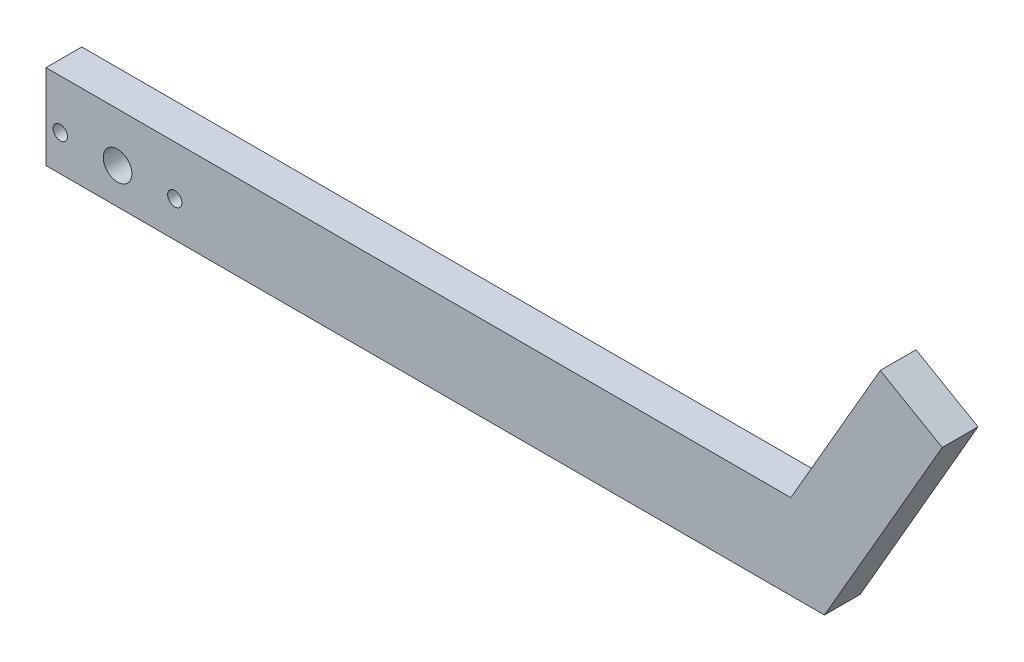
ISO-10303-21;
HEADER;
FILE_DESCRIPTION(('STEP AP214'),'2;1');
FILE_NAME('part.step','',(''),(''),'','','');
FILE_SCHEMA(('AUTOMOTIVE_DESIGN { 1 0 10303 214 1 1 1 1 }'));
ENDSEC;
DATA;
#1=APPLICATION_CONTEXT('core data for automotive mechanical design processes');
#2=APPLICATION_PROTOCOL_DEFINITION('international standard','automotive_design',2000,#1);
#3=PRODUCT_CONTEXT('',#1,'mechanical');
#4=PRODUCT('Part','Part','',(#3));
#5=PRODUCT_RELATED_PRODUCT_CATEGORY('part','',(#4));
#6=PRODUCT_DEFINITION_FORMATION('','',#4);
#7=PRODUCT_DEFINITION_CONTEXT('part definition',#1,'design');
#8=PRODUCT_DEFINITION('design','',#6,#7);
#9=PRODUCT_DEFINITION_SHAPE('','',#8);
#10=(LENGTH_UNIT() NAMED_UNIT(*) SI_UNIT(.MILLI.,.METRE.));
#11=(NAMED_UNIT(*) PLANE_ANGLE_UNIT() SI_UNIT($,.RADIAN.));
#12=(NAMED_UNIT(*) SI_UNIT($,.STERADIAN.) SOLID_ANGLE_UNIT());
#13=UNCERTAINTY_MEASURE_WITH_UNIT(LENGTH_MEASURE(1.E-05),#10,'distance_accuracy_value','');
#14=(GEOMETRIC_REPRESENTATION_CONTEXT(3) GLOBAL_UNCERTAINTY_ASSIGNED_CONTEXT((#13)) GLOBAL_UNIT_ASSIGNED_CONTEXT((#10,
#11,#12)) REPRESENTATION_CONTEXT('',''));
#15=CARTESIAN_POINT('',(0.,0.,0.));
#16=DIRECTION('',(0.,0.,1.));
#17=DIRECTION('',(1.,0.,0.));
#18=AXIS2_PLACEMENT_3D('',#15,#16,#17);
#19=CARTESIAN_POINT('',(-50.,6.86428620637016,5.));
#20=DIRECTION('',(1.,0.,0.));
#21=DIRECTION('',(0.,0.,-1.));
#22=AXIS2_PLACEMENT_3D('',#19,#20,#21);
#23=PLANE('',#22);
#24=DIRECTION('',(0.,-1.,0.));
#25=VECTOR('',#24,1.);
#26=CARTESIAN_POINT('',(-50.,6.86428620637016,0.));
#27=LINE('',#26,#25);
#28=CARTESIAN_POINT('',(-50.,6.86428620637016,0.));
#29=VERTEX_POINT('',#28);
#30=CARTESIAN_POINT('',(-50.,-5.,0.));
#31=VERTEX_POINT('',#30);
#32=EDGE_CURVE('E117',#29,#31,#27,.T.);
#33=ORIENTED_EDGE('',*,*,#32,.T.);
#34=DIRECTION('',(0.,0.,-1.));
#35=VECTOR('',#34,1.);
#36=CARTESIAN_POINT('',(-50.,-5.,5.));
#37=LINE('',#36,#35);
#38=CARTESIAN_POINT('',(-50.,-5.,5.));
#39=VERTEX_POINT('',#38);
#40=EDGE_CURVE('E11',#39,#31,#37,.T.);
#41=ORIENTED_EDGE('',*,*,#40,.F.);
#42=DIRECTION('',(0.,-1.,0.));
#43=VECTOR('',#42,1.);
#44=CARTESIAN_POINT('',(-50.,6.86428620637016,5.));
#45=LINE('',#44,#43);
#46=CARTESIAN_POINT('',(-50.,6.86428620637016,5.));
#47=VERTEX_POINT('',#46);
#48=EDGE_CURVE('E128',#47,#39,#45,.T.);
#49=ORIENTED_EDGE('',*,*,#48,.F.);
#50=DIRECTION('',(0.,0.,-1.));
#51=VECTOR('',#50,1.);
#52=CARTESIAN_POINT('',(-50.,6.86428620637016,5.));
#53=LINE('',#52,#51);
#54=EDGE_CURVE('E113',#47,#29,#53,.T.);
#55=ORIENTED_EDGE('',*,*,#54,.T.);
#56=EDGE_LOOP('',(#33,#41,#49,#55));
#57=FACE_BOUND('',#56,.T.);
#58=ADVANCED_FACE('F33',(#57),#23,.F.);
#59=CARTESIAN_POINT('',(48.8776351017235,-5.,5.));
#60=DIRECTION('',(0.,1.,0.));
#61=DIRECTION('',(-1.,0.,0.));
#62=AXIS2_PLACEMENT_3D('',#59,#60,#61);
#63=PLANE('',#62);
#64=DIRECTION('',(1.,0.,0.));
#65=VECTOR('',#64,1.);
#66=CARTESIAN_POINT('',(48.8776351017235,-5.,0.));
#67=LINE('',#66,#65);
#68=CARTESIAN_POINT('',(58.8066124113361,-5.,0.));
#69=VERTEX_POINT('',#68);
#70=EDGE_CURVE('E120',#31,#69,#67,.T.);
#71=ORIENTED_EDGE('',*,*,#70,.T.);
#72=DIRECTION('',(0.,0.,-1.));
#73=VECTOR('',#72,1.);
#74=CARTESIAN_POINT('',(58.8066124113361,-5.,5.));
#75=LINE('',#74,#73);
#76=CARTESIAN_POINT('',(58.8066124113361,-5.,5.));
#77=VERTEX_POINT('',#76);
#78=EDGE_CURVE('E41',#77,#69,#75,.T.);
#79=ORIENTED_EDGE('',*,*,#78,.F.);
#80=DIRECTION('',(1.,0.,0.));
#81=VECTOR('',#80,1.);
#82=CARTESIAN_POINT('',(-50.,-5.,5.));
#83=LINE('',#82,#81);
#84=EDGE_CURVE('E86',#39,#77,#83,.T.);
#85=ORIENTED_EDGE('',*,*,#84,.F.);
#86=ORIENTED_EDGE('',*,*,#40,.T.);
#87=EDGE_LOOP('',(#71,#79,#85,#86));
#88=FACE_BOUND('',#87,.T.);
#89=ADVANCED_FACE('F153',(#88),#63,.F.);
#90=CARTESIAN_POINT('',(75.2697099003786,23.5149213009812,5.));
#91=DIRECTION('',(-0.866025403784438,0.5,0.));
#92=DIRECTION('',(-0.5,-0.866025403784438,0.));
#93=AXIS2_PLACEMENT_3D('',#90,#91,#92);
#94=PLANE('',#93);
#95=DIRECTION('',(0.5,0.866025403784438,0.));
#96=VECTOR('',#95,1.);
#97=CARTESIAN_POINT('',(75.2697099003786,23.5149213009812,0.));
#98=LINE('',#97,#96);
#99=CARTESIAN_POINT('',(75.2697099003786,23.5149213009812,0.));
#100=VERTEX_POINT('',#99);
#101=EDGE_CURVE('E123',#69,#100,#98,.T.);
#102=ORIENTED_EDGE('',*,*,#101,.T.);
#103=DIRECTION('',(0.,0.,-1.));
#104=VECTOR('',#103,1.);
#105=CARTESIAN_POINT('',(75.2697099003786,23.5149213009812,5.));
#106=LINE('',#105,#104);
#107=CARTESIAN_POINT('',(75.2697099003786,23.5149213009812,5.));
#108=VERTEX_POINT('',#107);
#109=EDGE_CURVE('E108',#108,#100,#106,.T.);
#110=ORIENTED_EDGE('',*,*,#109,.F.);
#111=DIRECTION('',(0.5,0.866025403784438,0.));
#112=VECTOR('',#111,1.);
#113=CARTESIAN_POINT('',(75.2697099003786,23.5149213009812,5.));
#114=LINE('',#113,#112);
#115=EDGE_CURVE('E99',#77,#108,#114,.T.);
#116=ORIENTED_EDGE('',*,*,#115,.F.);
#117=ORIENTED_EDGE('',*,*,#78,.T.);
#118=EDGE_LOOP('',(#102,#110,#116,#117));
#119=FACE_BOUND('',#118,.T.);
#120=ADVANCED_FACE('F134',(#119),#94,.F.);
#121=CARTESIAN_POINT('',(66.6094558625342,28.5149213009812,5.));
#122=DIRECTION('',(-0.499999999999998,-0.86602540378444,0.));
#123=DIRECTION('',(0.86602540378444,-0.499999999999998,0.));
#124=AXIS2_PLACEMENT_3D('',#121,#122,#123);
#125=PLANE('',#124);
#126=DIRECTION('',(-0.86602540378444,0.499999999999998,0.));
#127=VECTOR('',#126,1.);
#128=CARTESIAN_POINT('',(66.6094558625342,28.5149213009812,0.));
#129=LINE('',#128,#127);
#130=CARTESIAN_POINT('',(66.6094558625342,28.5149213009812,0.));
#131=VERTEX_POINT('',#130);
#132=EDGE_CURVE('E107',#100,#131,#129,.T.);
#133=ORIENTED_EDGE('',*,*,#132,.T.);
#134=DIRECTION('',(0.,0.,-1.));
#135=VECTOR('',#134,1.);
#136=CARTESIAN_POINT('',(66.6094558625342,28.5149213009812,5.));
#137=LINE('',#136,#135);
#138=CARTESIAN_POINT('',(66.6094558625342,28.5149213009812,5.));
#139=VERTEX_POINT('',#138);
#140=EDGE_CURVE('E104',#139,#131,#137,.T.);
#141=ORIENTED_EDGE('',*,*,#140,.F.);
#142=DIRECTION('',(-0.86602540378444,0.499999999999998,0.));
#143=VECTOR('',#142,1.);
#144=CARTESIAN_POINT('',(66.6094558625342,28.5149213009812,5.));
#145=LINE('',#144,#143);
#146=EDGE_CURVE('E93',#108,#139,#145,.T.);
#147=ORIENTED_EDGE('',*,*,#146,.F.);
#148=ORIENTED_EDGE('',*,*,#109,.T.);
#149=EDGE_LOOP('',(#133,#141,#147,#148));
#150=FACE_BOUND('',#149,.T.);
#151=ADVANCED_FACE('F105',(#150),#125,.F.);
#152=CARTESIAN_POINT('',(54.1094558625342,6.86428620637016,5.));
#153=DIRECTION('',(0.86602540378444,-0.499999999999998,0.));
#154=DIRECTION('',(0.499999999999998,0.86602540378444,0.));
#155=AXIS2_PLACEMENT_3D('',#152,#153,#154);
#156=PLANE('',#155);
#157=DIRECTION('',(-0.499999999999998,-0.86602540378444,0.));
#158=VECTOR('',#157,1.);
#159=CARTESIAN_POINT('',(54.1094558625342,6.86428620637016,0.));
#160=LINE('',#159,#158);
#161=CARTESIAN_POINT('',(54.1094558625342,6.86428620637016,0.));
#162=VERTEX_POINT('',#161);
#163=EDGE_CURVE('E72',#131,#162,#160,.T.);
#164=ORIENTED_EDGE('',*,*,#163,.T.);
#165=DIRECTION('',(0.,0.,-1.));
#166=VECTOR('',#165,1.);
#167=CARTESIAN_POINT('',(54.1094558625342,6.86428620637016,5.));
#168=LINE('',#167,#166);
#169=CARTESIAN_POINT('',(54.1094558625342,6.86428620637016,5.));
#170=VERTEX_POINT('',#169);
#171=EDGE_CURVE('E109',#170,#162,#168,.T.);
#172=ORIENTED_EDGE('',*,*,#171,.F.);
#173=DIRECTION('',(-0.499999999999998,-0.86602540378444,0.));
#174=VECTOR('',#173,1.);
#175=CARTESIAN_POINT('',(54.1094558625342,6.86428620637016,5.));
#176=LINE('',#175,#174);
#177=EDGE_CURVE('E97',#139,#170,#176,.T.);
#178=ORIENTED_EDGE('',*,*,#177,.F.);
#179=ORIENTED_EDGE('',*,*,#140,.T.);
#180=EDGE_LOOP('',(#164,#172,#178,#179));
#181=FACE_BOUND('',#180,.T.);
#182=ADVANCED_FACE('F111',(#181),#156,.F.);
#183=CARTESIAN_POINT('',(-50.,6.86428620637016,5.));
#184=DIRECTION('',(0.,-1.,0.));
#185=DIRECTION('',(1.,0.,0.));
#186=AXIS2_PLACEMENT_3D('',#183,#184,#185);
#187=PLANE('',#186);
#188=DIRECTION('',(-1.,0.,0.));
#189=VECTOR('',#188,1.);
#190=CARTESIAN_POINT('',(-50.,6.86428620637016,0.));
#191=LINE('',#190,#189);
#192=EDGE_CURVE('E78',#162,#29,#191,.T.);
#193=ORIENTED_EDGE('',*,*,#192,.T.);
#194=ORIENTED_EDGE('',*,*,#54,.F.);
#195=DIRECTION('',(-1.,0.,0.));
#196=VECTOR('',#195,1.);
#197=CARTESIAN_POINT('',(-50.,6.86428620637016,5.));
#198=LINE('',#197,#196);
#199=EDGE_CURVE('E49',#170,#47,#198,.T.);
#200=ORIENTED_EDGE('',*,*,#199,.F.);
#201=ORIENTED_EDGE('',*,*,#171,.T.);
#202=EDGE_LOOP('',(#193,#194,#200,#201));
#203=FACE_BOUND('',#202,.T.);
#204=ADVANCED_FACE('F141',(#203),#187,.F.);
#205=CARTESIAN_POINT('',(0.,0.,5.));
#206=DIRECTION('',(0.,0.,1.));
#207=DIRECTION('',(1.,0.,0.));
#208=AXIS2_PLACEMENT_3D('',#205,#206,#207);
#209=PLANE('',#208);
#210=CARTESIAN_POINT('',(-32.,0.,5.));
#211=DIRECTION('',(0.,0.,1.));
#212=DIRECTION('',(1.,0.,0.));
#213=AXIS2_PLACEMENT_3D('',#210,#211,#212);
#214=CIRCLE('',#213,0.999999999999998);
#215=CARTESIAN_POINT('',(-31.,0.,5.));
#216=VERTEX_POINT('',#215);
#217=EDGE_CURVE('E229',#216,#216,#214,.T.);
#218=ORIENTED_EDGE('',*,*,#217,.F.);
#219=EDGE_LOOP('',(#218));
#220=FACE_BOUND('',#219,.T.);
#221=CARTESIAN_POINT('',(-48.,0.,5.));
#222=DIRECTION('',(0.,0.,1.));
#223=DIRECTION('',(1.,0.,0.));
#224=AXIS2_PLACEMENT_3D('',#221,#222,#223);
#225=CIRCLE('',#224,0.999999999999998);
#226=CARTESIAN_POINT('',(-47.,0.,5.));
#227=VERTEX_POINT('',#226);
#228=EDGE_CURVE('E231',#227,#227,#225,.T.);
#229=ORIENTED_EDGE('',*,*,#228,.F.);
#230=EDGE_LOOP('',(#229));
#231=FACE_BOUND('',#230,.T.);
#232=CARTESIAN_POINT('',(-40.,0.,5.));
#233=DIRECTION('',(0.,0.,1.));
#234=DIRECTION('',(1.,0.,0.));
#235=AXIS2_PLACEMENT_3D('',#232,#233,#234);
#236=CIRCLE('',#235,2.);
#237=CARTESIAN_POINT('',(-38.,0.,5.));
#238=VERTEX_POINT('',#237);
#239=EDGE_CURVE('E237',#238,#238,#236,.T.);
#240=ORIENTED_EDGE('',*,*,#239,.F.);
#241=EDGE_LOOP('',(#240));
#242=FACE_BOUND('',#241,.T.);
#243=ORIENTED_EDGE('',*,*,#48,.T.);
#244=ORIENTED_EDGE('',*,*,#84,.T.);
#245=ORIENTED_EDGE('',*,*,#115,.T.);
#246=ORIENTED_EDGE('',*,*,#146,.T.);
#247=ORIENTED_EDGE('',*,*,#177,.T.);
#248=ORIENTED_EDGE('',*,*,#199,.T.);
#249=EDGE_LOOP('',(#243,#244,#245,#246,#247,#248));
#250=FACE_BOUND('',#249,.T.);
#251=ADVANCED_FACE('F95',(#220,#231,#242,#250),#209,.T.);
#252=CARTESIAN_POINT('',(0.,0.,0.));
#253=DIRECTION('',(0.,0.,1.));
#254=DIRECTION('',(1.,0.,0.));
#255=AXIS2_PLACEMENT_3D('',#252,#253,#254);
#256=PLANE('',#255);
#257=CARTESIAN_POINT('',(-32.,0.,0.));
#258=DIRECTION('',(0.,0.,1.));
#259=DIRECTION('',(1.,0.,0.));
#260=AXIS2_PLACEMENT_3D('',#257,#258,#259);
#261=CIRCLE('',#260,0.999999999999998);
#262=CARTESIAN_POINT('',(-31.,0.,0.));
#263=VERTEX_POINT('',#262);
#264=EDGE_CURVE('E226',#263,#263,#261,.T.);
#265=ORIENTED_EDGE('',*,*,#264,.T.);
#266=EDGE_LOOP('',(#265));
#267=FACE_BOUND('',#266,.T.);
#268=CARTESIAN_POINT('',(-48.,0.,0.));
#269=DIRECTION('',(0.,0.,1.));
#270=DIRECTION('',(1.,0.,0.));
#271=AXIS2_PLACEMENT_3D('',#268,#269,#270);
#272=CIRCLE('',#271,0.999999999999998);
#273=CARTESIAN_POINT('',(-47.,0.,0.));
#274=VERTEX_POINT('',#273);
#275=EDGE_CURVE('E234',#274,#274,#272,.T.);
#276=ORIENTED_EDGE('',*,*,#275,.T.);
#277=EDGE_LOOP('',(#276));
#278=FACE_BOUND('',#277,.T.);
#279=CARTESIAN_POINT('',(-40.,0.,0.));
#280=DIRECTION('',(0.,0.,1.));
#281=DIRECTION('',(1.,0.,0.));
#282=AXIS2_PLACEMENT_3D('',#279,#280,#281);
#283=CIRCLE('',#282,2.);
#284=CARTESIAN_POINT('',(-38.,0.,0.));
#285=VERTEX_POINT('',#284);
#286=EDGE_CURVE('E121',#285,#285,#283,.T.);
#287=ORIENTED_EDGE('',*,*,#286,.T.);
#288=EDGE_LOOP('',(#287));
#289=FACE_BOUND('',#288,.T.);
#290=ORIENTED_EDGE('',*,*,#32,.F.);
#291=ORIENTED_EDGE('',*,*,#192,.F.);
#292=ORIENTED_EDGE('',*,*,#163,.F.);
#293=ORIENTED_EDGE('',*,*,#132,.F.);
#294=ORIENTED_EDGE('',*,*,#101,.F.);
#295=ORIENTED_EDGE('',*,*,#70,.F.);
#296=EDGE_LOOP('',(#290,#291,#292,#293,#294,#295));
#297=FACE_BOUND('',#296,.T.);
#298=ADVANCED_FACE('F137',(#267,#278,#289,#297),#256,.F.);
#299=CARTESIAN_POINT('',(-40.,0.,0.));
#300=DIRECTION('',(0.,0.,1.));
#301=DIRECTION('',(1.,0.,0.));
#302=AXIS2_PLACEMENT_3D('',#299,#300,#301);
#303=CYLINDRICAL_SURFACE('',#302,2.);
#304=ORIENTED_EDGE('',*,*,#286,.F.);
#305=EDGE_LOOP('',(#304));
#306=FACE_BOUND('',#305,.T.);
#307=ORIENTED_EDGE('',*,*,#239,.T.);
#308=EDGE_LOOP('',(#307));
#309=FACE_BOUND('',#308,.T.);
#310=ADVANCED_FACE('F190',(#306,#309),#303,.F.);
#311=CARTESIAN_POINT('',(-48.,0.,0.));
#312=DIRECTION('',(0.,0.,1.));
#313=DIRECTION('',(1.,0.,0.));
#314=AXIS2_PLACEMENT_3D('',#311,#312,#313);
#315=CYLINDRICAL_SURFACE('',#314,0.999999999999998);
#316=ORIENTED_EDGE('',*,*,#275,.F.);
#317=EDGE_LOOP('',(#316));
#318=FACE_BOUND('',#317,.T.);
#319=ORIENTED_EDGE('',*,*,#228,.T.);
#320=EDGE_LOOP('',(#319));
#321=FACE_BOUND('',#320,.T.);
#322=ADVANCED_FACE('F199',(#318,#321),#315,.F.);
#323=CARTESIAN_POINT('',(-32.,0.,0.));
#324=DIRECTION('',(0.,0.,1.));
#325=DIRECTION('',(1.,0.,0.));
#326=AXIS2_PLACEMENT_3D('',#323,#324,#325);
#327=CYLINDRICAL_SURFACE('',#326,0.999999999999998);
#328=ORIENTED_EDGE('',*,*,#264,.F.);
#329=EDGE_LOOP('',(#328));
#330=FACE_BOUND('',#329,.T.);
#331=ORIENTED_EDGE('',*,*,#217,.T.);
#332=EDGE_LOOP('',(#331));
#333=FACE_BOUND('',#332,.T.);
#334=ADVANCED_FACE('F209',(#330,#333),#327,.F.);
#335=CLOSED_SHELL('',(#58,#89,#120,#151,#182,#204,#251,#298,#310,#322,#334));
#336=MANIFOLD_SOLID_BREP('B2',#335);
#337=ADVANCED_BREP_SHAPE_REPRESENTATION('',(#18,#336),#14);
#338=SHAPE_DEFINITION_REPRESENTATION(#9,#337);
ENDSEC;
END-ISO-10303-21;
